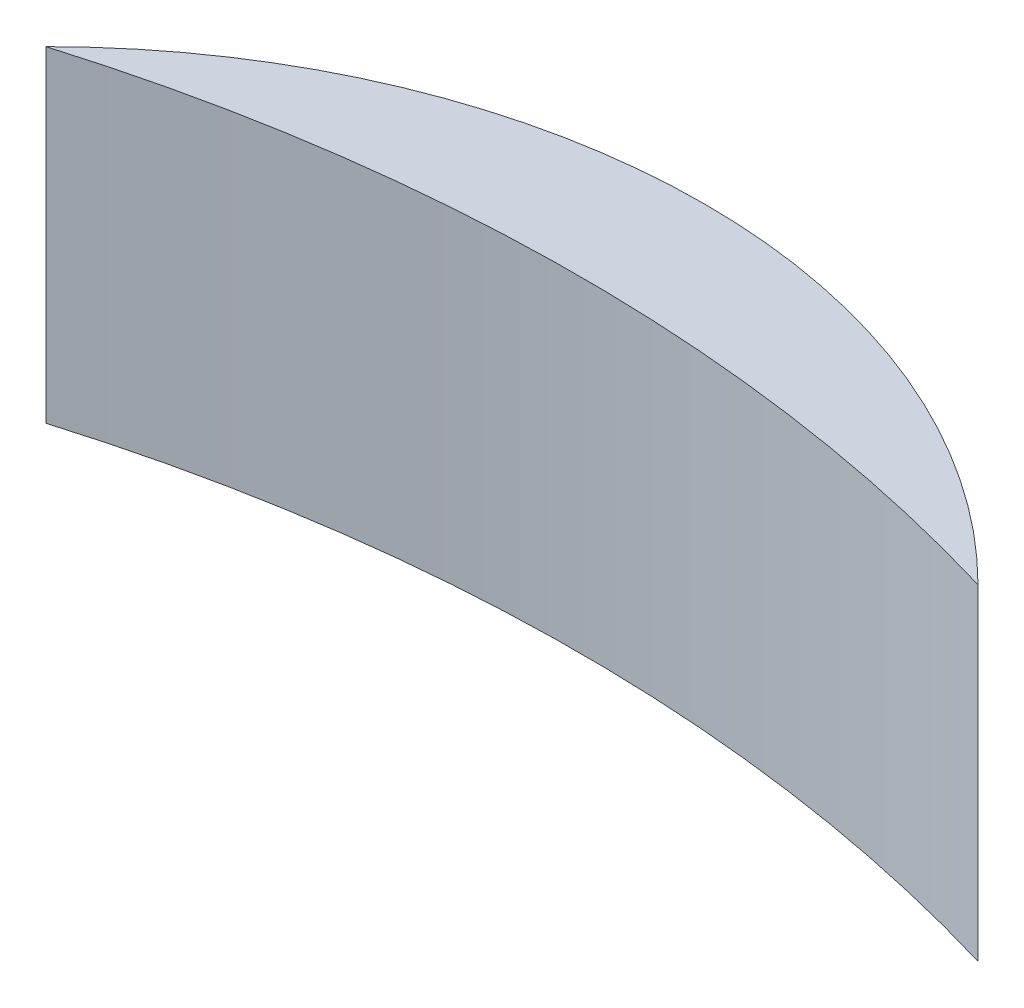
from build123d import *

# Parameters (mm, degrees)
BOSS_EXTRUDE1_DEPTH = 17.78


with BuildPart() as part:
    # Sketch1 → Boss-Extrude1 (new body)
    with BuildSketch(Plane(origin=(0, 0, 0), x_dir=(1, 0, 0), z_dir=(0, 1, 0))):
        with BuildLine():
            ThreePointArc((-25.4, 0), (0, 10.521024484), (25.4, 0))
            ThreePointArc((25.4, 0), (0, 3.705810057), (-25.4, 0))
        make_face()
    extrude(amount=BOSS_EXTRUDE1_DEPTH)


solid = part.part
